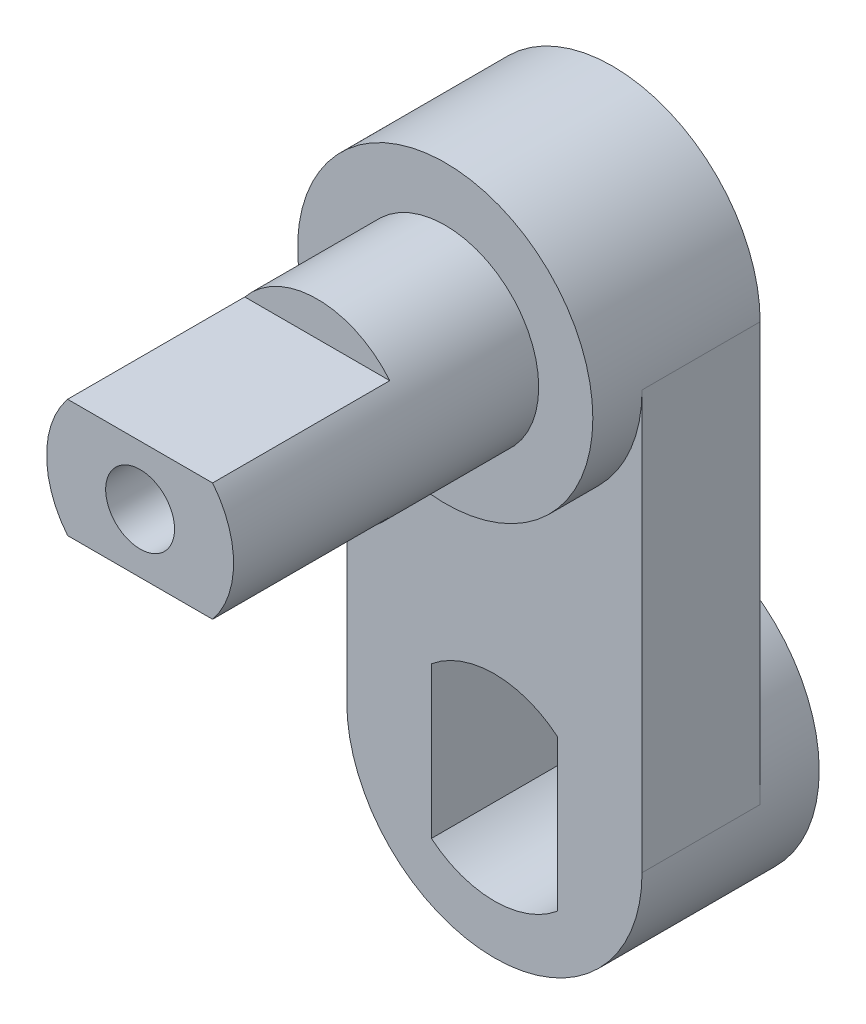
from build123d import *

# Parameters (mm, degrees)
ESQUISSE1_R             = 7.5
BOSS_EXTRU_1_DEPTH      = 9
BOSS_EXTRU_2_START      = -6
BOSS_EXTRU_2_DEPTH      = 6
ESQUISSE4_R             = 7.5
BOSS_EXTRU_3_DEPTH      = 2.5
ESQUISSE5_R             = 4.75
BOSS_EXTRU_4_DEPTH      = 6.5
BOSS_EXTRU_5_DEPTH      = 9
ESQUISSE7_R             = 1.75
ENL_V_MAT_EXTRU_1_DEPTH = 37
CHANFREIN1_SIZE         = 1.5


with BuildPart() as part:
    # Esquisse1 → Boss.-Extru.1 (new body)
    with BuildSketch(Plane.XY):
        Circle(ESQUISSE1_R)
        with BuildLine():
            Line((-3.2, 0), (-3.2, 3.841874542))
            ThreePointArc((-3.2, 3.841874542), (0, 5), (3.2, 3.841874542))
            Line((3.2, 3.841874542), (3.2, 0))
            Line((3.2, 0), (3.2, -3.841874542))
            ThreePointArc((3.2, -3.841874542), (0, -5), (-3.2, -3.841874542))
            Line((-3.2, -3.841874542), (-3.2, 0))
        make_face(mode=Mode.SUBTRACT)
    extrude(amount=BOSS_EXTRU_1_DEPTH)

    # Esquisse2 → Boss.-Extru.2 (add)
    with BuildSketch(Plane.XY.offset(9).offset(BOSS_EXTRU_2_START)):
        with BuildLine():
            ThreePointArc((-7.5, 0), (-5.303300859, 5.303300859), (0, 7.5))
            ThreePointArc((0, 7.5), (5.303300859, 5.303300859), (7.5, 0))
            Line((7.5, 0), (7.5, 21.24))
            ThreePointArc((7.5, 21.24), (0, 28.74), (-7.5, 21.24))
            Line((-7.5, 21.24), (-7.5, 0))
        make_face()
    extrude(amount=BOSS_EXTRU_2_DEPTH)

    # Esquisse4 → Boss.-Extru.3 (add)
    with BuildSketch(Plane.XY.offset(9)):
        with Locations((0, 21.24)):
            Circle(ESQUISSE4_R)
    extrude(amount=BOSS_EXTRU_3_DEPTH)

    # Esquisse5 → Boss.-Extru.4 (add)
    with BuildSketch(Plane.XY.offset(11.5)):
        with Locations(Location((0, 21.24, 0), (0, 0, 180))):
            Circle(ESQUISSE5_R)
    extrude(amount=BOSS_EXTRU_4_DEPTH)

    # Esquisse6 → Boss.-Extru.5 (add)
    with BuildSketch(Plane.XY.offset(18)):
        with BuildLine():
            Line((0, 24.24), (0, 21.24))
            Line((0, 21.24), (0, 18.24))
            Line((0, 18.24), (3.682729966, 18.24))
            ThreePointArc((3.682729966, 18.24), (4.475235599, 19.647905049), (4.75, 21.24))
            ThreePointArc((4.75, 21.24), (4.475235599, 22.832094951), (3.682729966, 24.24))
            Line((3.682729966, 24.24), (0, 24.24))
        make_face()
        with BuildLine():
            Line((-4.75, 21.24), (0, 21.24))
            Line((0, 21.24), (0, 24.24))
            Line((0, 24.24), (-3.682729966, 24.24))
            ThreePointArc((-3.682729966, 24.24), (-4.475235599, 22.832094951), (-4.75, 21.24))
        make_face()
        with BuildLine():
            Line((0, 18.24), (0, 21.24))
            Line((0, 21.24), (-4.75, 21.24))
            ThreePointArc((-4.75, 21.24), (-4.475235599, 19.647905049), (-3.682729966, 18.24))
            Line((-3.682729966, 18.24), (0, 18.24))
        make_face()
    extrude(amount=BOSS_EXTRU_5_DEPTH)

    # Esquisse7 → Enl_v. mat.-Extru.1 (cut)
    with BuildSketch(Plane.XY.offset(27)):
        with Locations((0, 21.24)):
            Circle(ESQUISSE7_R)
    extrude(amount=-ENL_V_MAT_EXTRU_1_DEPTH, mode=Mode.SUBTRACT)

    # Chanfrein1
    chanfrein1_edges = [part.edges().sort_by_distance(p)[0] for p in [
        (-1.75, 21.24, 3),
    ]]
    chamfer(chanfrein1_edges, length=CHANFREIN1_SIZE)


solid = part.part
